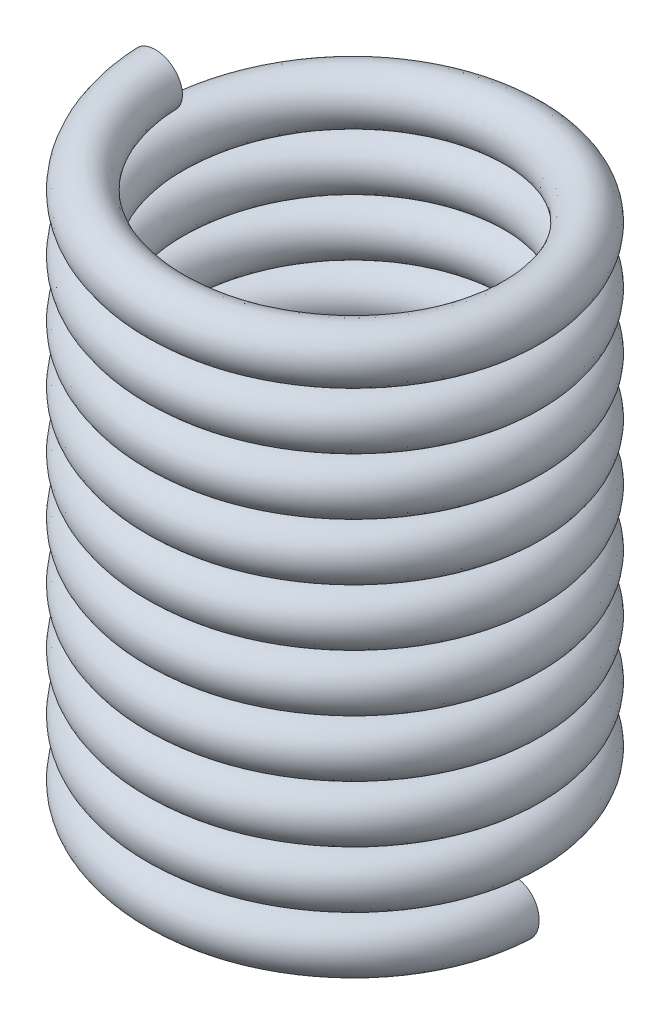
from build123d import *

# Parameters (mm, degrees)
SWEEP2_PITCH       = 0.363621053
SWEEP2_HEIGHT      = 3.4544
SWEEP2_RADIUS      = 1.143
SWEEP2_START_ANGLE = 90
SKETCH4_R          = 0.1651


with BuildPart() as part:
    # Sweep2: sweep along a helix
    with BuildLine() as sweep2_path:
        add(Helix(SWEEP2_PITCH, SWEEP2_HEIGHT, SWEEP2_RADIUS, center=(0, 0, 0), direction=(0, 1, 0), lefthand=True, mode=Mode.PRIVATE).rotate(Axis((0, 0, 0), (0, 1, 0)), SWEEP2_START_ANGLE))
    # Sketch4 → Sweep2 (sweep)
    with BuildSketch(Plane(origin=(1.143, 0, 0), x_dir=(1, 0, 0), z_dir=(2.9135093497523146e-15, 0.050566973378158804, 0.9987206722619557))):
        Circle(SKETCH4_R)
    sweep(path=sweep2_path.line, is_frenet=True)


solid = part.part
